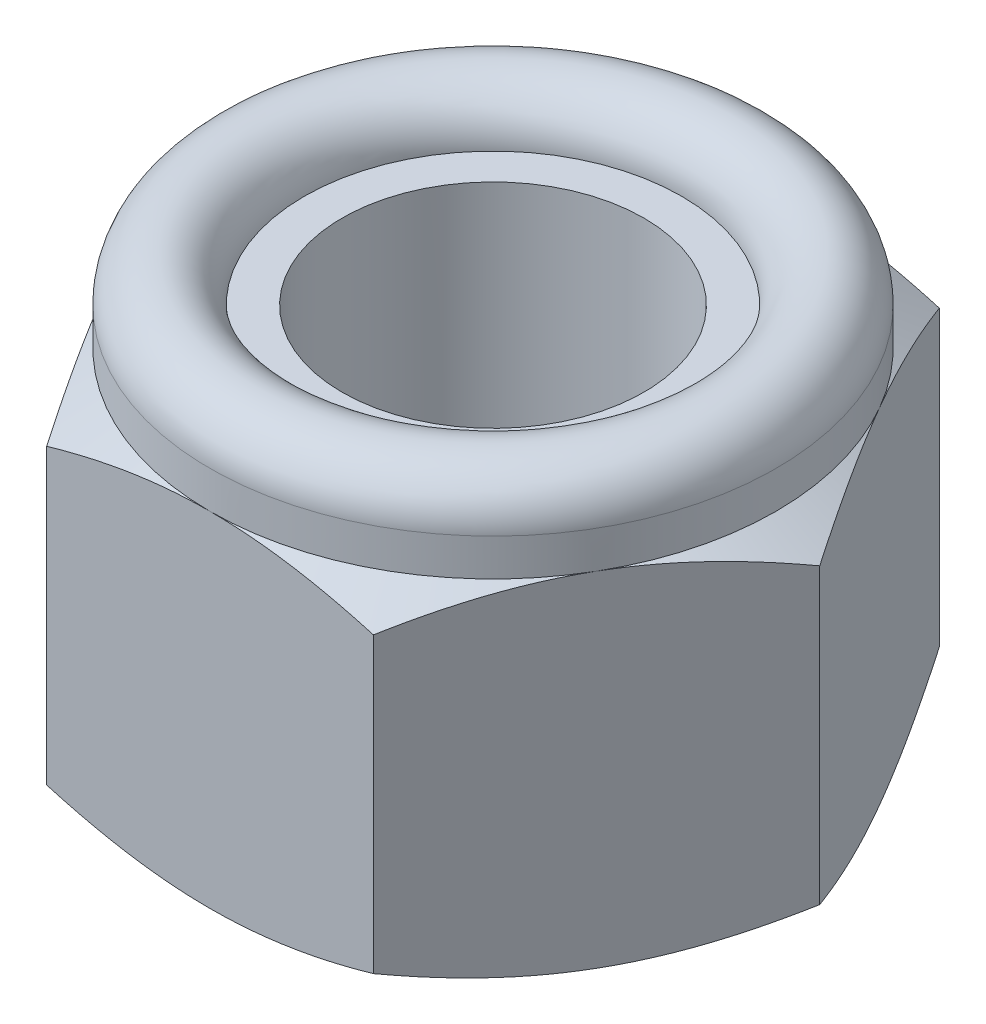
from build123d import *

# Parameters (mm, degrees)
ESQUISSE2_OUTSIDE_W      = 57.256
ESQUISSE2_OUTSIDE_H      = 57.256
HEXAGONE_DEPTH           = 38.620340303
CHANFREIN_INF_RIEUR_SIZE = 2


with BuildPart() as part:
    # Esquisse1 → Base (revolve)
    with BuildSketch(Plane.XY, mode=Mode.PRIVATE) as base_sk:
        with BuildLine():
            Line((10, 20.2), (12.5, 20.2))
            Line((12.5, 20.2), (12.5, 15.850932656))
            Line((12.5, 15.850932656), (8, 14.64516129))
            Line((8, 14.64516129), (8, 0))
            Line((8, 0), (15.000000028, 0))
            Line((15.000000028, 0), (21.213203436, 3.587194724))
            Line((21.213203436, 3.587194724), (21.213203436, 14.64516129))
            Line((21.213203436, 14.64516129), (15, 18.232355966))
            Line((15, 18.232355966), (15, 20.2))
            ThreePointArc((15, 20.2), (12.5, 22.7), (10, 20.2))
        make_face()
    revolve(base_sk.sketch.rotate(Axis((0, 0, 0), (0, 1, 0)), 90), axis=Axis((0, 0, 0), (0, 1, 0)))

    # Esquisse2 outside → Hexagone (cut, through all)
    with BuildSketch(Plane(origin=(0, 0, 0), x_dir=(1, 0, 0), z_dir=(0, 1, 0))):
        Rectangle(ESQUISSE2_OUTSIDE_W, ESQUISSE2_OUTSIDE_H)
        Polygon((-8.660254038, 15), (8.660254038, 15), (17.320508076, 0), (8.660254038, -15), (-8.660254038, -15), (-17.320508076, 0), align=None, mode=Mode.SUBTRACT)
    extrude(amount=HEXAGONE_DEPTH, mode=Mode.SUBTRACT)

    # Chanfrein inf_rieur
    chanfrein_inf_rieur_edges = [part.edges().sort_by_distance(p)[0] for p in [
        (0, 0, 8),
    ]]
    chamfer(chanfrein_inf_rieur_edges, length=CHANFREIN_INF_RIEUR_SIZE)

    # Esquisse4 → Bague frein (revolve)
    with BuildSketch(Plane.XY, mode=Mode.PRIVATE) as bague_frein_sk:
        Polygon((12.5, 20.2), (8, 20.2), (8, 14.64516129), (12.5, 15.850932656), align=None)
    revolve(bague_frein_sk.sketch.rotate(Axis((0, 9.913170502, 0), (0, -1, 0)), 270), axis=Axis((0, 9.913170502, 0), (0, -1, 0)))


solid = part.part
